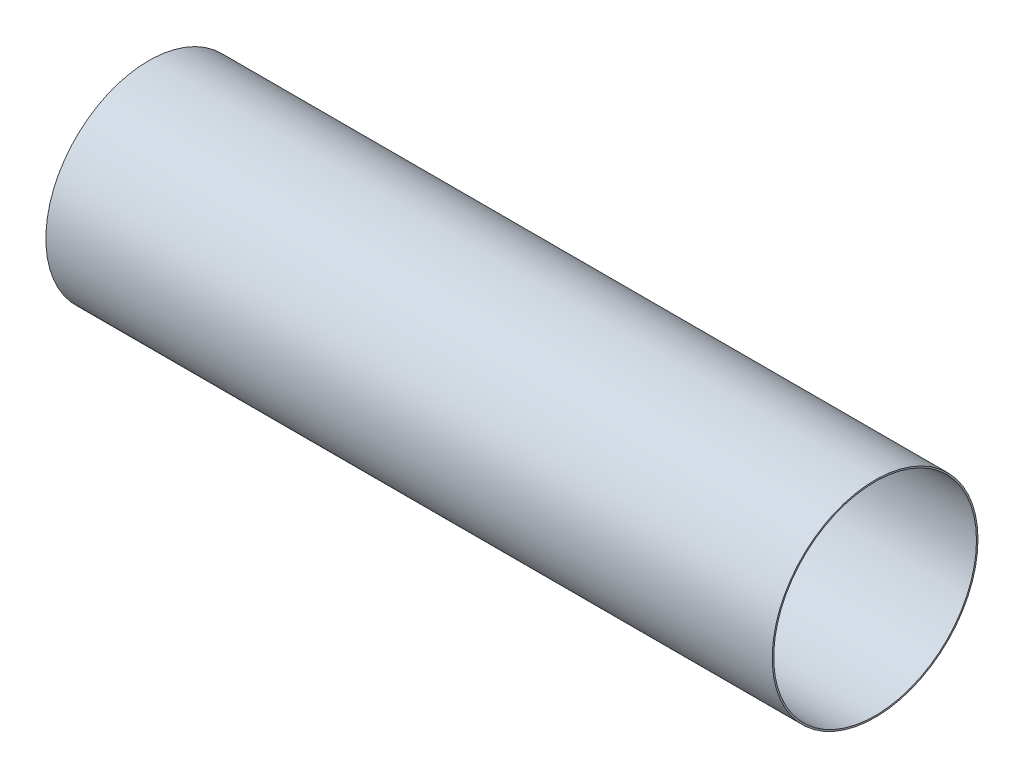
from build123d import *

# Parameters (mm, degrees)
SKETCH1_R      = 17
SKETCH1_R_2    = 16.75
EXTRUDE1_DEPTH = 120


with BuildPart() as part:
    # Sketch1 → Extrude1 (new body)
    with BuildSketch(Plane(origin=(0, 0, 0), x_dir=(0, 0, -1), z_dir=(1, 0, 0))):
        Circle(SKETCH1_R)
        Circle(SKETCH1_R_2, mode=Mode.SUBTRACT)
    extrude(amount=EXTRUDE1_DEPTH)


solid = part.part
